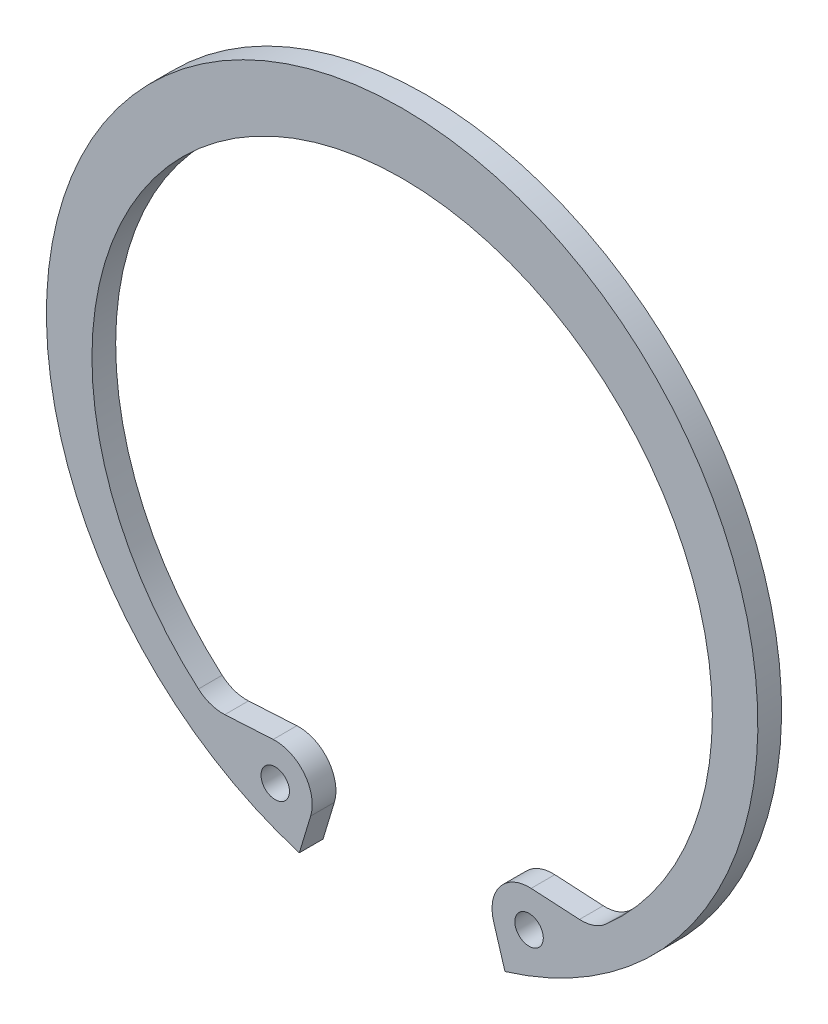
ISO-10303-21;
HEADER;
FILE_DESCRIPTION(('STEP AP214'),'2;1');
FILE_NAME('part.step','',(''),(''),'','','');
FILE_SCHEMA(('AUTOMOTIVE_DESIGN { 1 0 10303 214 1 1 1 1 }'));
ENDSEC;
DATA;
#1=APPLICATION_CONTEXT('core data for automotive mechanical design processes');
#2=APPLICATION_PROTOCOL_DEFINITION('international standard','automotive_design',2000,#1);
#3=PRODUCT_CONTEXT('',#1,'mechanical');
#4=PRODUCT('Part','Part','',(#3));
#5=PRODUCT_RELATED_PRODUCT_CATEGORY('part','',(#4));
#6=PRODUCT_DEFINITION_FORMATION('','',#4);
#7=PRODUCT_DEFINITION_CONTEXT('part definition',#1,'design');
#8=PRODUCT_DEFINITION('design','',#6,#7);
#9=PRODUCT_DEFINITION_SHAPE('','',#8);
#10=(LENGTH_UNIT() NAMED_UNIT(*) SI_UNIT(.MILLI.,.METRE.));
#11=(NAMED_UNIT(*) PLANE_ANGLE_UNIT() SI_UNIT($,.RADIAN.));
#12=(NAMED_UNIT(*) SI_UNIT($,.STERADIAN.) SOLID_ANGLE_UNIT());
#13=UNCERTAINTY_MEASURE_WITH_UNIT(LENGTH_MEASURE(1.E-05),#10,'distance_accuracy_value','');
#14=(GEOMETRIC_REPRESENTATION_CONTEXT(3) GLOBAL_UNCERTAINTY_ASSIGNED_CONTEXT((#13)) GLOBAL_UNIT_ASSIGNED_CONTEXT((#10,
#11,#12)) REPRESENTATION_CONTEXT('',''));
#15=CARTESIAN_POINT('',(0.,0.,0.));
#16=DIRECTION('',(0.,0.,1.));
#17=DIRECTION('',(1.,0.,0.));
#18=AXIS2_PLACEMENT_3D('',#15,#16,#17);
#19=CARTESIAN_POINT('',(0.,0.,2.5));
#20=DIRECTION('',(0.,0.,1.));
#21=DIRECTION('',(1.,0.,0.));
#22=AXIS2_PLACEMENT_3D('',#19,#20,#21);
#23=PLANE('',#22);
#24=CARTESIAN_POINT('',(13.3793733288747,-30.8212973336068,2.5));
#25=DIRECTION('',(0.,0.,1.));
#26=DIRECTION('',(1.,0.,0.));
#27=AXIS2_PLACEMENT_3D('',#24,#25,#26);
#28=CIRCLE('',#27,1.5);
#29=CARTESIAN_POINT('',(11.8793733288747,-30.8212973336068,2.5));
#30=VERTEX_POINT('',#29);
#31=EDGE_CURVE('E145',#30,#30,#28,.T.);
#32=ORIENTED_EDGE('',*,*,#31,.F.);
#33=EDGE_LOOP('',(#32));
#34=FACE_BOUND('',#33,.T.);
#35=CARTESIAN_POINT('',(0.,0.,2.5));
#36=DIRECTION('',(0.,0.,1.));
#37=DIRECTION('',(1.,0.,0.));
#38=AXIS2_PLACEMENT_3D('',#35,#36,#37);
#39=CIRCLE('',#38,37.5);
#40=CARTESIAN_POINT('',(10.8386923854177,-35.8994811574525,2.5));
#41=VERTEX_POINT('',#40);
#42=CARTESIAN_POINT('',(-10.8386923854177,-35.8994811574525,2.5));
#43=VERTEX_POINT('',#42);
#44=EDGE_CURVE('E160',#41,#43,#39,.T.);
#45=ORIENTED_EDGE('',*,*,#44,.T.);
#46=DIRECTION('',(0.289031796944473,0.957319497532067,0.));
#47=VECTOR('',#46,1.);
#48=CARTESIAN_POINT('',(-9.64582728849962,-31.9485213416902,2.5));
#49=LINE('',#48,#47);
#50=CARTESIAN_POINT('',(-9.64582728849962,-31.9485213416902,2.5));
#51=VERTEX_POINT('',#50);
#52=EDGE_CURVE('E98',#43,#51,#49,.T.);
#53=ORIENTED_EDGE('',*,*,#52,.T.);
#54=CARTESIAN_POINT('',(-13.3793733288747,-30.8212973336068,2.5));
#55=DIRECTION('',(0.,0.,1.));
#56=DIRECTION('',(-1.,0.,0.));
#57=AXIS2_PLACEMENT_3D('',#54,#55,#56);
#58=CIRCLE('',#57,3.9);
#59=CARTESIAN_POINT('',(-13.597077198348,-26.9273783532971,2.5));
#60=VERTEX_POINT('',#59);
#61=EDGE_CURVE('E181',#51,#60,#58,.T.);
#62=ORIENTED_EDGE('',*,*,#61,.T.);
#63=DIRECTION('',(-0.998440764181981,-0.0558215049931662,0.));
#64=VECTOR('',#63,1.);
#65=CARTESIAN_POINT('',(-18.6964250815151,-27.2124761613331,2.5));
#66=LINE('',#65,#64);
#67=CARTESIAN_POINT('',(-18.6964250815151,-27.2124761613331,2.5));
#68=VERTEX_POINT('',#67);
#69=EDGE_CURVE('E200',#60,#68,#66,.T.);
#70=ORIENTED_EDGE('',*,*,#69,.T.);
#71=CARTESIAN_POINT('',(-18.9141289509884,-23.3185571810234,2.5));
#72=DIRECTION('',(0.,0.,-1.));
#73=DIRECTION('',(-1.,0.,0.));
#74=AXIS2_PLACEMENT_3D('',#71,#72,#73);
#75=CIRCLE('',#74,3.9);
#76=CARTESIAN_POINT('',(-21.4754172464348,-26.259611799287,2.5));
#77=VERTEX_POINT('',#76);
#78=EDGE_CURVE('E197',#68,#77,#75,.T.);
#79=ORIENTED_EDGE('',*,*,#78,.T.);
#80=CARTESIAN_POINT('',(0.,-1.6,2.5));
#81=DIRECTION('',(0.,0.,-1.));
#82=DIRECTION('',(1.,0.,0.));
#83=AXIS2_PLACEMENT_3D('',#80,#81,#82);
#84=CIRCLE('',#83,32.7);
#85=CARTESIAN_POINT('',(21.4754172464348,-26.259611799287,2.5));
#86=VERTEX_POINT('',#85);
#87=EDGE_CURVE('E199',#77,#86,#84,.T.);
#88=ORIENTED_EDGE('',*,*,#87,.T.);
#89=CARTESIAN_POINT('',(18.9141289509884,-23.3185571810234,2.5));
#90=DIRECTION('',(0.,0.,-1.));
#91=DIRECTION('',(1.,0.,0.));
#92=AXIS2_PLACEMENT_3D('',#89,#90,#91);
#93=CIRCLE('',#92,3.9);
#94=CARTESIAN_POINT('',(18.6964250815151,-27.2124761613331,2.5));
#95=VERTEX_POINT('',#94);
#96=EDGE_CURVE('E123',#86,#95,#93,.T.);
#97=ORIENTED_EDGE('',*,*,#96,.T.);
#98=DIRECTION('',(-0.998440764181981,0.0558215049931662,0.));
#99=VECTOR('',#98,1.);
#100=CARTESIAN_POINT('',(18.6964250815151,-27.2124761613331,2.5));
#101=LINE('',#100,#99);
#102=CARTESIAN_POINT('',(13.597077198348,-26.9273783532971,2.5));
#103=VERTEX_POINT('',#102);
#104=EDGE_CURVE('E117',#95,#103,#101,.T.);
#105=ORIENTED_EDGE('',*,*,#104,.T.);
#106=CARTESIAN_POINT('',(13.3793733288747,-30.8212973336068,2.5));
#107=DIRECTION('',(0.,0.,1.));
#108=DIRECTION('',(1.,0.,0.));
#109=AXIS2_PLACEMENT_3D('',#106,#107,#108);
#110=CIRCLE('',#109,3.9);
#111=CARTESIAN_POINT('',(9.64582728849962,-31.9485213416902,2.5));
#112=VERTEX_POINT('',#111);
#113=EDGE_CURVE('E121',#103,#112,#110,.T.);
#114=ORIENTED_EDGE('',*,*,#113,.T.);
#115=DIRECTION('',(0.289031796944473,-0.957319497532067,0.));
#116=VECTOR('',#115,1.);
#117=CARTESIAN_POINT('',(9.64582728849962,-31.9485213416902,2.5));
#118=LINE('',#117,#116);
#119=EDGE_CURVE('E49',#112,#41,#118,.T.);
#120=ORIENTED_EDGE('',*,*,#119,.T.);
#121=EDGE_LOOP('',(#45,#53,#62,#70,#79,#88,#97,#105,#114,#120));
#122=FACE_BOUND('',#121,.T.);
#123=CARTESIAN_POINT('',(-13.3793733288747,-30.8212973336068,2.5));
#124=DIRECTION('',(0.,0.,1.));
#125=DIRECTION('',(-1.,0.,0.));
#126=AXIS2_PLACEMENT_3D('',#123,#124,#125);
#127=CIRCLE('',#126,1.5);
#128=CARTESIAN_POINT('',(-14.8793733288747,-30.8212973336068,2.5));
#129=VERTEX_POINT('',#128);
#130=EDGE_CURVE('E211',#129,#129,#127,.T.);
#131=ORIENTED_EDGE('',*,*,#130,.F.);
#132=EDGE_LOOP('',(#131));
#133=FACE_BOUND('',#132,.T.);
#134=ADVANCED_FACE('F32',(#34,#122,#133),#23,.T.);
#135=CARTESIAN_POINT('',(0.,0.,0.));
#136=DIRECTION('',(0.,0.,1.));
#137=DIRECTION('',(1.,0.,0.));
#138=AXIS2_PLACEMENT_3D('',#135,#136,#137);
#139=PLANE('',#138);
#140=CARTESIAN_POINT('',(13.3793733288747,-30.8212973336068,0.));
#141=DIRECTION('',(0.,0.,1.));
#142=DIRECTION('',(1.,0.,0.));
#143=AXIS2_PLACEMENT_3D('',#140,#141,#142);
#144=CIRCLE('',#143,1.5);
#145=CARTESIAN_POINT('',(11.8793733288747,-30.8212973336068,0.));
#146=VERTEX_POINT('',#145);
#147=EDGE_CURVE('E208',#146,#146,#144,.T.);
#148=ORIENTED_EDGE('',*,*,#147,.T.);
#149=EDGE_LOOP('',(#148));
#150=FACE_BOUND('',#149,.T.);
#151=CARTESIAN_POINT('',(0.,0.,0.));
#152=DIRECTION('',(0.,0.,1.));
#153=DIRECTION('',(1.,0.,0.));
#154=AXIS2_PLACEMENT_3D('',#151,#152,#153);
#155=CIRCLE('',#154,37.5);
#156=CARTESIAN_POINT('',(10.8386923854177,-35.8994811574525,0.));
#157=VERTEX_POINT('',#156);
#158=CARTESIAN_POINT('',(-10.8386923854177,-35.8994811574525,0.));
#159=VERTEX_POINT('',#158);
#160=EDGE_CURVE('E141',#157,#159,#155,.T.);
#161=ORIENTED_EDGE('',*,*,#160,.F.);
#162=DIRECTION('',(0.289031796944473,-0.957319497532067,0.));
#163=VECTOR('',#162,1.);
#164=CARTESIAN_POINT('',(9.64582728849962,-31.9485213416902,0.));
#165=LINE('',#164,#163);
#166=CARTESIAN_POINT('',(9.64582728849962,-31.9485213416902,0.));
#167=VERTEX_POINT('',#166);
#168=EDGE_CURVE('E90',#167,#157,#165,.T.);
#169=ORIENTED_EDGE('',*,*,#168,.F.);
#170=CARTESIAN_POINT('',(13.3793733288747,-30.8212973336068,0.));
#171=DIRECTION('',(0.,0.,1.));
#172=DIRECTION('',(1.,0.,0.));
#173=AXIS2_PLACEMENT_3D('',#170,#171,#172);
#174=CIRCLE('',#173,3.9);
#175=CARTESIAN_POINT('',(13.597077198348,-26.9273783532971,0.));
#176=VERTEX_POINT('',#175);
#177=EDGE_CURVE('E84',#176,#167,#174,.T.);
#178=ORIENTED_EDGE('',*,*,#177,.F.);
#179=DIRECTION('',(-0.998440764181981,0.0558215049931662,0.));
#180=VECTOR('',#179,1.);
#181=CARTESIAN_POINT('',(18.6964250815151,-27.2124761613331,0.));
#182=LINE('',#181,#180);
#183=CARTESIAN_POINT('',(18.6964250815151,-27.2124761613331,0.));
#184=VERTEX_POINT('',#183);
#185=EDGE_CURVE('E131',#184,#176,#182,.T.);
#186=ORIENTED_EDGE('',*,*,#185,.F.);
#187=CARTESIAN_POINT('',(18.9141289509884,-23.3185571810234,0.));
#188=DIRECTION('',(0.,0.,-1.));
#189=DIRECTION('',(1.,0.,0.));
#190=AXIS2_PLACEMENT_3D('',#187,#188,#189);
#191=CIRCLE('',#190,3.9);
#192=CARTESIAN_POINT('',(21.4754172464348,-26.259611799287,0.));
#193=VERTEX_POINT('',#192);
#194=EDGE_CURVE('E155',#193,#184,#191,.T.);
#195=ORIENTED_EDGE('',*,*,#194,.F.);
#196=CARTESIAN_POINT('',(0.,-1.6,0.));
#197=DIRECTION('',(0.,0.,-1.));
#198=DIRECTION('',(1.,0.,0.));
#199=AXIS2_PLACEMENT_3D('',#196,#197,#198);
#200=CIRCLE('',#199,32.7);
#201=CARTESIAN_POINT('',(-21.4754172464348,-26.259611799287,0.));
#202=VERTEX_POINT('',#201);
#203=EDGE_CURVE('E153',#202,#193,#200,.T.);
#204=ORIENTED_EDGE('',*,*,#203,.F.);
#205=CARTESIAN_POINT('',(-18.9141289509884,-23.3185571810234,0.));
#206=DIRECTION('',(0.,0.,-1.));
#207=DIRECTION('',(-1.,0.,0.));
#208=AXIS2_PLACEMENT_3D('',#205,#206,#207);
#209=CIRCLE('',#208,3.9);
#210=CARTESIAN_POINT('',(-18.6964250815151,-27.2124761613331,0.));
#211=VERTEX_POINT('',#210);
#212=EDGE_CURVE('E151',#211,#202,#209,.T.);
#213=ORIENTED_EDGE('',*,*,#212,.F.);
#214=DIRECTION('',(-0.998440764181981,-0.0558215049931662,0.));
#215=VECTOR('',#214,1.);
#216=CARTESIAN_POINT('',(-18.6964250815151,-27.2124761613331,0.));
#217=LINE('',#216,#215);
#218=CARTESIAN_POINT('',(-13.597077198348,-26.9273783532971,0.));
#219=VERTEX_POINT('',#218);
#220=EDGE_CURVE('E149',#219,#211,#217,.T.);
#221=ORIENTED_EDGE('',*,*,#220,.F.);
#222=CARTESIAN_POINT('',(-13.3793733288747,-30.8212973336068,0.));
#223=DIRECTION('',(0.,0.,1.));
#224=DIRECTION('',(-1.,0.,0.));
#225=AXIS2_PLACEMENT_3D('',#222,#223,#224);
#226=CIRCLE('',#225,3.9);
#227=CARTESIAN_POINT('',(-9.64582728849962,-31.9485213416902,0.));
#228=VERTEX_POINT('',#227);
#229=EDGE_CURVE('E147',#228,#219,#226,.T.);
#230=ORIENTED_EDGE('',*,*,#229,.F.);
#231=DIRECTION('',(0.289031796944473,0.957319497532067,0.));
#232=VECTOR('',#231,1.);
#233=CARTESIAN_POINT('',(-9.64582728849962,-31.9485213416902,0.));
#234=LINE('',#233,#232);
#235=EDGE_CURVE('E144',#159,#228,#234,.T.);
#236=ORIENTED_EDGE('',*,*,#235,.F.);
#237=EDGE_LOOP('',(#161,#169,#178,#186,#195,#204,#213,#221,#230,#236));
#238=FACE_BOUND('',#237,.T.);
#239=CARTESIAN_POINT('',(-13.3793733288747,-30.8212973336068,0.));
#240=DIRECTION('',(0.,0.,1.));
#241=DIRECTION('',(-1.,0.,0.));
#242=AXIS2_PLACEMENT_3D('',#239,#240,#241);
#243=CIRCLE('',#242,1.5);
#244=CARTESIAN_POINT('',(-14.8793733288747,-30.8212973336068,0.));
#245=VERTEX_POINT('',#244);
#246=EDGE_CURVE('E214',#245,#245,#243,.T.);
#247=ORIENTED_EDGE('',*,*,#246,.T.);
#248=EDGE_LOOP('',(#247));
#249=FACE_BOUND('',#248,.T.);
#250=ADVANCED_FACE('F185',(#150,#238,#249),#139,.F.);
#251=CARTESIAN_POINT('',(0.,0.,2.5));
#252=DIRECTION('',(0.,0.,-1.));
#253=DIRECTION('',(-1.,0.,0.));
#254=AXIS2_PLACEMENT_3D('',#251,#252,#253);
#255=CYLINDRICAL_SURFACE('',#254,37.5);
#256=ORIENTED_EDGE('',*,*,#160,.T.);
#257=DIRECTION('',(0.,0.,-1.));
#258=VECTOR('',#257,1.);
#259=CARTESIAN_POINT('',(-10.8386923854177,-35.8994811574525,2.5));
#260=LINE('',#259,#258);
#261=EDGE_CURVE('E11',#43,#159,#260,.T.);
#262=ORIENTED_EDGE('',*,*,#261,.F.);
#263=ORIENTED_EDGE('',*,*,#44,.F.);
#264=DIRECTION('',(0.,0.,-1.));
#265=VECTOR('',#264,1.);
#266=CARTESIAN_POINT('',(10.8386923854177,-35.8994811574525,2.5));
#267=LINE('',#266,#265);
#268=EDGE_CURVE('E137',#41,#157,#267,.T.);
#269=ORIENTED_EDGE('',*,*,#268,.T.);
#270=EDGE_LOOP('',(#256,#262,#263,#269));
#271=FACE_BOUND('',#270,.T.);
#272=ADVANCED_FACE('F34',(#271),#255,.T.);
#273=CARTESIAN_POINT('',(-9.64582728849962,-31.9485213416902,2.5));
#274=DIRECTION('',(-0.957319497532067,0.289031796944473,0.));
#275=DIRECTION('',(-0.289031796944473,-0.957319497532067,0.));
#276=AXIS2_PLACEMENT_3D('',#273,#274,#275);
#277=PLANE('',#276);
#278=ORIENTED_EDGE('',*,*,#235,.T.);
#279=DIRECTION('',(0.,0.,-1.));
#280=VECTOR('',#279,1.);
#281=CARTESIAN_POINT('',(-9.64582728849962,-31.9485213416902,2.5));
#282=LINE('',#281,#280);
#283=EDGE_CURVE('E41',#51,#228,#282,.T.);
#284=ORIENTED_EDGE('',*,*,#283,.F.);
#285=ORIENTED_EDGE('',*,*,#52,.F.);
#286=ORIENTED_EDGE('',*,*,#261,.T.);
#287=EDGE_LOOP('',(#278,#284,#285,#286));
#288=FACE_BOUND('',#287,.T.);
#289=ADVANCED_FACE('F255',(#288),#277,.F.);
#290=CARTESIAN_POINT('',(-13.3793733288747,-30.8212973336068,2.5));
#291=DIRECTION('',(0.,0.,-1.));
#292=DIRECTION('',(-1.,0.,0.));
#293=AXIS2_PLACEMENT_3D('',#290,#291,#292);
#294=CYLINDRICAL_SURFACE('',#293,3.9);
#295=ORIENTED_EDGE('',*,*,#229,.T.);
#296=DIRECTION('',(0.,0.,-1.));
#297=VECTOR('',#296,1.);
#298=CARTESIAN_POINT('',(-13.597077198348,-26.9273783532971,2.5));
#299=LINE('',#298,#297);
#300=EDGE_CURVE('E173',#60,#219,#299,.T.);
#301=ORIENTED_EDGE('',*,*,#300,.F.);
#302=ORIENTED_EDGE('',*,*,#61,.F.);
#303=ORIENTED_EDGE('',*,*,#283,.T.);
#304=EDGE_LOOP('',(#295,#301,#302,#303));
#305=FACE_BOUND('',#304,.T.);
#306=ADVANCED_FACE('F179',(#305),#294,.T.);
#307=CARTESIAN_POINT('',(-18.6964250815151,-27.2124761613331,2.5));
#308=DIRECTION('',(0.0558215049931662,-0.998440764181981,0.));
#309=DIRECTION('',(0.998440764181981,0.0558215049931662,0.));
#310=AXIS2_PLACEMENT_3D('',#307,#308,#309);
#311=PLANE('',#310);
#312=ORIENTED_EDGE('',*,*,#220,.T.);
#313=DIRECTION('',(0.,0.,-1.));
#314=VECTOR('',#313,1.);
#315=CARTESIAN_POINT('',(-18.6964250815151,-27.2124761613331,2.5));
#316=LINE('',#315,#314);
#317=EDGE_CURVE('E170',#68,#211,#316,.T.);
#318=ORIENTED_EDGE('',*,*,#317,.F.);
#319=ORIENTED_EDGE('',*,*,#69,.F.);
#320=ORIENTED_EDGE('',*,*,#300,.T.);
#321=EDGE_LOOP('',(#312,#318,#319,#320));
#322=FACE_BOUND('',#321,.T.);
#323=ADVANCED_FACE('F191',(#322),#311,.F.);
#324=CARTESIAN_POINT('',(-18.9141289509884,-23.3185571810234,2.5));
#325=DIRECTION('',(0.,0.,-1.));
#326=DIRECTION('',(-1.,0.,0.));
#327=AXIS2_PLACEMENT_3D('',#324,#325,#326);
#328=CYLINDRICAL_SURFACE('',#327,3.9);
#329=ORIENTED_EDGE('',*,*,#212,.T.);
#330=DIRECTION('',(0.,0.,-1.));
#331=VECTOR('',#330,1.);
#332=CARTESIAN_POINT('',(-21.4754172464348,-26.259611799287,2.5));
#333=LINE('',#332,#331);
#334=EDGE_CURVE('E167',#77,#202,#333,.T.);
#335=ORIENTED_EDGE('',*,*,#334,.F.);
#336=ORIENTED_EDGE('',*,*,#78,.F.);
#337=ORIENTED_EDGE('',*,*,#317,.T.);
#338=EDGE_LOOP('',(#329,#335,#336,#337));
#339=FACE_BOUND('',#338,.T.);
#340=ADVANCED_FACE('F195',(#339),#328,.F.);
#341=CARTESIAN_POINT('',(0.,-1.6,2.5));
#342=DIRECTION('',(0.,0.,-1.));
#343=DIRECTION('',(-1.,0.,0.));
#344=AXIS2_PLACEMENT_3D('',#341,#342,#343);
#345=CYLINDRICAL_SURFACE('',#344,32.7);
#346=ORIENTED_EDGE('',*,*,#203,.T.);
#347=DIRECTION('',(0.,0.,-1.));
#348=VECTOR('',#347,1.);
#349=CARTESIAN_POINT('',(21.4754172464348,-26.259611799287,2.5));
#350=LINE('',#349,#348);
#351=EDGE_CURVE('E164',#86,#193,#350,.T.);
#352=ORIENTED_EDGE('',*,*,#351,.F.);
#353=ORIENTED_EDGE('',*,*,#87,.F.);
#354=ORIENTED_EDGE('',*,*,#334,.T.);
#355=EDGE_LOOP('',(#346,#352,#353,#354));
#356=FACE_BOUND('',#355,.T.);
#357=ADVANCED_FACE('F245',(#356),#345,.F.);
#358=CARTESIAN_POINT('',(18.9141289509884,-23.3185571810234,2.5));
#359=DIRECTION('',(0.,0.,-1.));
#360=DIRECTION('',(-1.,0.,0.));
#361=AXIS2_PLACEMENT_3D('',#358,#359,#360);
#362=CYLINDRICAL_SURFACE('',#361,3.9);
#363=ORIENTED_EDGE('',*,*,#194,.T.);
#364=DIRECTION('',(0.,0.,-1.));
#365=VECTOR('',#364,1.);
#366=CARTESIAN_POINT('',(18.6964250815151,-27.2124761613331,2.5));
#367=LINE('',#366,#365);
#368=EDGE_CURVE('E132',#95,#184,#367,.T.);
#369=ORIENTED_EDGE('',*,*,#368,.F.);
#370=ORIENTED_EDGE('',*,*,#96,.F.);
#371=ORIENTED_EDGE('',*,*,#351,.T.);
#372=EDGE_LOOP('',(#363,#369,#370,#371));
#373=FACE_BOUND('',#372,.T.);
#374=ADVANCED_FACE('F242',(#373),#362,.F.);
#375=CARTESIAN_POINT('',(18.6964250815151,-27.2124761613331,2.5));
#376=DIRECTION('',(-0.0558215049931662,-0.998440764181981,0.));
#377=DIRECTION('',(0.998440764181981,-0.0558215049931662,0.));
#378=AXIS2_PLACEMENT_3D('',#375,#376,#377);
#379=PLANE('',#378);
#380=ORIENTED_EDGE('',*,*,#185,.T.);
#381=DIRECTION('',(0.,0.,-1.));
#382=VECTOR('',#381,1.);
#383=CARTESIAN_POINT('',(13.597077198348,-26.9273783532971,2.5));
#384=LINE('',#383,#382);
#385=EDGE_CURVE('E128',#103,#176,#384,.T.);
#386=ORIENTED_EDGE('',*,*,#385,.F.);
#387=ORIENTED_EDGE('',*,*,#104,.F.);
#388=ORIENTED_EDGE('',*,*,#368,.T.);
#389=EDGE_LOOP('',(#380,#386,#387,#388));
#390=FACE_BOUND('',#389,.T.);
#391=ADVANCED_FACE('F129',(#390),#379,.F.);
#392=CARTESIAN_POINT('',(13.3793733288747,-30.8212973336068,2.5));
#393=DIRECTION('',(0.,0.,-1.));
#394=DIRECTION('',(-1.,0.,0.));
#395=AXIS2_PLACEMENT_3D('',#392,#393,#394);
#396=CYLINDRICAL_SURFACE('',#395,3.9);
#397=ORIENTED_EDGE('',*,*,#177,.T.);
#398=DIRECTION('',(0.,0.,-1.));
#399=VECTOR('',#398,1.);
#400=CARTESIAN_POINT('',(9.64582728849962,-31.9485213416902,2.5));
#401=LINE('',#400,#399);
#402=EDGE_CURVE('E133',#112,#167,#401,.T.);
#403=ORIENTED_EDGE('',*,*,#402,.F.);
#404=ORIENTED_EDGE('',*,*,#113,.F.);
#405=ORIENTED_EDGE('',*,*,#385,.T.);
#406=EDGE_LOOP('',(#397,#403,#404,#405));
#407=FACE_BOUND('',#406,.T.);
#408=ADVANCED_FACE('F135',(#407),#396,.T.);
#409=CARTESIAN_POINT('',(9.64582728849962,-31.9485213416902,2.5));
#410=DIRECTION('',(0.957319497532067,0.289031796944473,0.));
#411=DIRECTION('',(-0.289031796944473,0.957319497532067,0.));
#412=AXIS2_PLACEMENT_3D('',#409,#410,#411);
#413=PLANE('',#412);
#414=ORIENTED_EDGE('',*,*,#168,.T.);
#415=ORIENTED_EDGE('',*,*,#268,.F.);
#416=ORIENTED_EDGE('',*,*,#119,.F.);
#417=ORIENTED_EDGE('',*,*,#402,.T.);
#418=EDGE_LOOP('',(#414,#415,#416,#417));
#419=FACE_BOUND('',#418,.T.);
#420=ADVANCED_FACE('F235',(#419),#413,.F.);
#421=CARTESIAN_POINT('',(13.3793733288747,-30.8212973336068,2.5));
#422=DIRECTION('',(0.,0.,-1.));
#423=DIRECTION('',(-1.,0.,0.));
#424=AXIS2_PLACEMENT_3D('',#421,#422,#423);
#425=CYLINDRICAL_SURFACE('',#424,1.5);
#426=CARTESIAN_POINT('',(11.8793733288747,-30.8212973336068,2.5));
#427=CARTESIAN_POINT('',(11.8793733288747,-30.8212973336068,2.47395833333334));
#428=CARTESIAN_POINT('',(11.8793733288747,-30.8212973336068,2.44791666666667));
#429=CARTESIAN_POINT('',(11.8793733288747,-30.8212973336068,2.39583333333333));
#430=CARTESIAN_POINT('',(11.8793733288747,-30.8212973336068,2.36979166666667));
#431=CARTESIAN_POINT('',(11.8793733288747,-30.8212973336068,2.31770833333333));
#432=CARTESIAN_POINT('',(11.8793733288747,-30.8212973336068,2.29166666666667));
#433=CARTESIAN_POINT('',(11.8793733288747,-30.8212973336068,2.23958333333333));
#434=CARTESIAN_POINT('',(11.8793733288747,-30.8212973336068,2.21354166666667));
#435=CARTESIAN_POINT('',(11.8793733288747,-30.8212973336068,2.16145833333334));
#436=CARTESIAN_POINT('',(11.8793733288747,-30.8212973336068,2.13541666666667));
#437=CARTESIAN_POINT('',(11.8793733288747,-30.8212973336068,2.08333333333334));
#438=CARTESIAN_POINT('',(11.8793733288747,-30.8212973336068,2.05729166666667));
#439=CARTESIAN_POINT('',(11.8793733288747,-30.8212973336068,2.00520833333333));
#440=CARTESIAN_POINT('',(11.8793733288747,-30.8212973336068,1.97916666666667));
#441=CARTESIAN_POINT('',(11.8793733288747,-30.8212973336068,1.92708333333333));
#442=CARTESIAN_POINT('',(11.8793733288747,-30.8212973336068,1.90104166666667));
#443=CARTESIAN_POINT('',(11.8793733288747,-30.8212973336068,1.84895833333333));
#444=CARTESIAN_POINT('',(11.8793733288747,-30.8212973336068,1.82291666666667));
#445=CARTESIAN_POINT('',(11.8793733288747,-30.8212973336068,1.77083333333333));
#446=CARTESIAN_POINT('',(11.8793733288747,-30.8212973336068,1.74479166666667));
#447=CARTESIAN_POINT('',(11.8793733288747,-30.8212973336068,1.69270833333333));
#448=CARTESIAN_POINT('',(11.8793733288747,-30.8212973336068,1.66666666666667));
#449=CARTESIAN_POINT('',(11.8793733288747,-30.8212973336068,1.61458333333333));
#450=CARTESIAN_POINT('',(11.8793733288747,-30.8212973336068,1.58854166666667));
#451=CARTESIAN_POINT('',(11.8793733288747,-30.8212973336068,1.53645833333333));
#452=CARTESIAN_POINT('',(11.8793733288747,-30.8212973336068,1.51041666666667));
#453=CARTESIAN_POINT('',(11.8793733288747,-30.8212973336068,1.45833333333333));
#454=CARTESIAN_POINT('',(11.8793733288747,-30.8212973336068,1.43229166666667));
#455=CARTESIAN_POINT('',(11.8793733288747,-30.8212973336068,1.38020833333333));
#456=CARTESIAN_POINT('',(11.8793733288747,-30.8212973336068,1.35416666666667));
#457=CARTESIAN_POINT('',(11.8793733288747,-30.8212973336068,1.30208333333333));
#458=CARTESIAN_POINT('',(11.8793733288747,-30.8212973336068,1.27604166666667));
#459=CARTESIAN_POINT('',(11.8793733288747,-30.8212973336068,1.22395833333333));
#460=CARTESIAN_POINT('',(11.8793733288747,-30.8212973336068,1.19791666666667));
#461=CARTESIAN_POINT('',(11.8793733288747,-30.8212973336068,1.14583333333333));
#462=CARTESIAN_POINT('',(11.8793733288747,-30.8212973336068,1.11979166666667));
#463=CARTESIAN_POINT('',(11.8793733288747,-30.8212973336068,1.06770833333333));
#464=CARTESIAN_POINT('',(11.8793733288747,-30.8212973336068,1.04166666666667));
#465=CARTESIAN_POINT('',(11.8793733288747,-30.8212973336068,0.989583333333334));
#466=CARTESIAN_POINT('',(11.8793733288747,-30.8212973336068,0.963541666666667));
#467=CARTESIAN_POINT('',(11.8793733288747,-30.8212973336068,0.911458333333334));
#468=CARTESIAN_POINT('',(11.8793733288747,-30.8212973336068,0.885416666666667));
#469=CARTESIAN_POINT('',(11.8793733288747,-30.8212973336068,0.833333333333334));
#470=CARTESIAN_POINT('',(11.8793733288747,-30.8212973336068,0.807291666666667));
#471=CARTESIAN_POINT('',(11.8793733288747,-30.8212973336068,0.755208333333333));
#472=CARTESIAN_POINT('',(11.8793733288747,-30.8212973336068,0.729166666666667));
#473=CARTESIAN_POINT('',(11.8793733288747,-30.8212973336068,0.677083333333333));
#474=CARTESIAN_POINT('',(11.8793733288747,-30.8212973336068,0.651041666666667));
#475=CARTESIAN_POINT('',(11.8793733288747,-30.8212973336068,0.598958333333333));
#476=CARTESIAN_POINT('',(11.8793733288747,-30.8212973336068,0.572916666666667));
#477=CARTESIAN_POINT('',(11.8793733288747,-30.8212973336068,0.520833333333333));
#478=CARTESIAN_POINT('',(11.8793733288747,-30.8212973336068,0.494791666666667));
#479=CARTESIAN_POINT('',(11.8793733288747,-30.8212973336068,0.442708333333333));
#480=CARTESIAN_POINT('',(11.8793733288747,-30.8212973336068,0.416666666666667));
#481=CARTESIAN_POINT('',(11.8793733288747,-30.8212973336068,0.364583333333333));
#482=CARTESIAN_POINT('',(11.8793733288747,-30.8212973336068,0.338541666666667));
#483=CARTESIAN_POINT('',(11.8793733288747,-30.8212973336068,0.286458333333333));
#484=CARTESIAN_POINT('',(11.8793733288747,-30.8212973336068,0.260416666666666));
#485=CARTESIAN_POINT('',(11.8793733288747,-30.8212973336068,0.208333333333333));
#486=CARTESIAN_POINT('',(11.8793733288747,-30.8212973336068,0.182291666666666));
#487=CARTESIAN_POINT('',(11.8793733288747,-30.8212973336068,0.130208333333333));
#488=CARTESIAN_POINT('',(11.8793733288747,-30.8212973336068,0.104166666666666));
#489=CARTESIAN_POINT('',(11.8793733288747,-30.8212973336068,0.052083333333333));
#490=CARTESIAN_POINT('',(11.8793733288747,-30.8212973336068,0.0260416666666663));
#491=CARTESIAN_POINT('',(11.8793733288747,-30.8212973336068,0.));
#492=B_SPLINE_CURVE_WITH_KNOTS('',3,(#426,#427,#428,#429,#430,#431,#432,#433,#434,#435,#436,
#437,#438,#439,#440,#441,#442,#443,#444,#445,#446,#447,#448,#449,#450,#451,#452,#453,#454,#455,
#456,#457,#458,#459,#460,#461,#462,#463,#464,#465,#466,#467,#468,#469,#470,#471,#472,#473,#474,
#475,#476,#477,#478,#479,#480,#481,#482,#483,#484,#485,#486,#487,#488,#489,#490,#491),
.UNSPECIFIED.,.F.,.F.,(4,2,2,2,2,2,2,2,2,2,2,2,2,2,2,2,2,2,2,2,2,2,2,2,2,2,2,2,2,2,2,2,4),(0.,
0.0781250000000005,0.156250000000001,0.234375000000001,0.312500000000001,0.390625,
0.468750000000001,0.546875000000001,0.625000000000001,0.703125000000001,0.781250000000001,
0.859375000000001,0.937500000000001,1.015625,1.09375,1.171875,1.25,1.328125,1.40625,1.484375,
1.5625,1.640625,1.71875,1.796875,1.875,1.953125,2.03125,2.109375,2.1875,2.265625,2.34375,
2.421875,2.5),.UNSPECIFIED.);
#493=EDGE_CURVE('BSEAM232',#30,#146,#492,.T.);
#494=ORIENTED_EDGE('',*,*,#31,.T.);
#495=ORIENTED_EDGE('',*,*,#147,.F.);
#496=ORIENTED_EDGE('',*,*,#493,.T.);
#497=ORIENTED_EDGE('',*,*,#493,.F.);
#498=EDGE_LOOP('',(#494,#496,#495,#497));
#499=FACE_BOUND('',#498,.T.);
#500=ADVANCED_FACE('F232',(#499),#425,.F.);
#501=CARTESIAN_POINT('',(-13.3793733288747,-30.8212973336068,2.5));
#502=DIRECTION('',(0.,0.,-1.));
#503=DIRECTION('',(-1.,0.,0.));
#504=AXIS2_PLACEMENT_3D('',#501,#502,#503);
#505=CYLINDRICAL_SURFACE('',#504,1.5);
#506=CARTESIAN_POINT('',(-14.8793733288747,-30.8212973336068,2.5));
#507=CARTESIAN_POINT('',(-14.8793733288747,-30.8212973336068,2.47395833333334));
#508=CARTESIAN_POINT('',(-14.8793733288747,-30.8212973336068,2.44791666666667));
#509=CARTESIAN_POINT('',(-14.8793733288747,-30.8212973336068,2.39583333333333));
#510=CARTESIAN_POINT('',(-14.8793733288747,-30.8212973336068,2.36979166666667));
#511=CARTESIAN_POINT('',(-14.8793733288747,-30.8212973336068,2.31770833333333));
#512=CARTESIAN_POINT('',(-14.8793733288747,-30.8212973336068,2.29166666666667));
#513=CARTESIAN_POINT('',(-14.8793733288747,-30.8212973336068,2.23958333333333));
#514=CARTESIAN_POINT('',(-14.8793733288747,-30.8212973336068,2.21354166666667));
#515=CARTESIAN_POINT('',(-14.8793733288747,-30.8212973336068,2.16145833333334));
#516=CARTESIAN_POINT('',(-14.8793733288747,-30.8212973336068,2.13541666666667));
#517=CARTESIAN_POINT('',(-14.8793733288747,-30.8212973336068,2.08333333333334));
#518=CARTESIAN_POINT('',(-14.8793733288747,-30.8212973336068,2.05729166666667));
#519=CARTESIAN_POINT('',(-14.8793733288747,-30.8212973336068,2.00520833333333));
#520=CARTESIAN_POINT('',(-14.8793733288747,-30.8212973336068,1.97916666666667));
#521=CARTESIAN_POINT('',(-14.8793733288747,-30.8212973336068,1.92708333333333));
#522=CARTESIAN_POINT('',(-14.8793733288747,-30.8212973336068,1.90104166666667));
#523=CARTESIAN_POINT('',(-14.8793733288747,-30.8212973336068,1.84895833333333));
#524=CARTESIAN_POINT('',(-14.8793733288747,-30.8212973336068,1.82291666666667));
#525=CARTESIAN_POINT('',(-14.8793733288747,-30.8212973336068,1.77083333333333));
#526=CARTESIAN_POINT('',(-14.8793733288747,-30.8212973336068,1.74479166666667));
#527=CARTESIAN_POINT('',(-14.8793733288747,-30.8212973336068,1.69270833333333));
#528=CARTESIAN_POINT('',(-14.8793733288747,-30.8212973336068,1.66666666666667));
#529=CARTESIAN_POINT('',(-14.8793733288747,-30.8212973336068,1.61458333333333));
#530=CARTESIAN_POINT('',(-14.8793733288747,-30.8212973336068,1.58854166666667));
#531=CARTESIAN_POINT('',(-14.8793733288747,-30.8212973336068,1.53645833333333));
#532=CARTESIAN_POINT('',(-14.8793733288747,-30.8212973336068,1.51041666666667));
#533=CARTESIAN_POINT('',(-14.8793733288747,-30.8212973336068,1.45833333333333));
#534=CARTESIAN_POINT('',(-14.8793733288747,-30.8212973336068,1.43229166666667));
#535=CARTESIAN_POINT('',(-14.8793733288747,-30.8212973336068,1.38020833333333));
#536=CARTESIAN_POINT('',(-14.8793733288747,-30.8212973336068,1.35416666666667));
#537=CARTESIAN_POINT('',(-14.8793733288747,-30.8212973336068,1.30208333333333));
#538=CARTESIAN_POINT('',(-14.8793733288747,-30.8212973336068,1.27604166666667));
#539=CARTESIAN_POINT('',(-14.8793733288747,-30.8212973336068,1.22395833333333));
#540=CARTESIAN_POINT('',(-14.8793733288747,-30.8212973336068,1.19791666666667));
#541=CARTESIAN_POINT('',(-14.8793733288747,-30.8212973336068,1.14583333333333));
#542=CARTESIAN_POINT('',(-14.8793733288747,-30.8212973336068,1.11979166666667));
#543=CARTESIAN_POINT('',(-14.8793733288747,-30.8212973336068,1.06770833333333));
#544=CARTESIAN_POINT('',(-14.8793733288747,-30.8212973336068,1.04166666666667));
#545=CARTESIAN_POINT('',(-14.8793733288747,-30.8212973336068,0.989583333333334));
#546=CARTESIAN_POINT('',(-14.8793733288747,-30.8212973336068,0.963541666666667));
#547=CARTESIAN_POINT('',(-14.8793733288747,-30.8212973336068,0.911458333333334));
#548=CARTESIAN_POINT('',(-14.8793733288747,-30.8212973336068,0.885416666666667));
#549=CARTESIAN_POINT('',(-14.8793733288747,-30.8212973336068,0.833333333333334));
#550=CARTESIAN_POINT('',(-14.8793733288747,-30.8212973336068,0.807291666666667));
#551=CARTESIAN_POINT('',(-14.8793733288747,-30.8212973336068,0.755208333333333));
#552=CARTESIAN_POINT('',(-14.8793733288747,-30.8212973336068,0.729166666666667));
#553=CARTESIAN_POINT('',(-14.8793733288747,-30.8212973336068,0.677083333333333));
#554=CARTESIAN_POINT('',(-14.8793733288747,-30.8212973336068,0.651041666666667));
#555=CARTESIAN_POINT('',(-14.8793733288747,-30.8212973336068,0.598958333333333));
#556=CARTESIAN_POINT('',(-14.8793733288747,-30.8212973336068,0.572916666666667));
#557=CARTESIAN_POINT('',(-14.8793733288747,-30.8212973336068,0.520833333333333));
#558=CARTESIAN_POINT('',(-14.8793733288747,-30.8212973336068,0.494791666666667));
#559=CARTESIAN_POINT('',(-14.8793733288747,-30.8212973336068,0.442708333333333));
#560=CARTESIAN_POINT('',(-14.8793733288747,-30.8212973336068,0.416666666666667));
#561=CARTESIAN_POINT('',(-14.8793733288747,-30.8212973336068,0.364583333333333));
#562=CARTESIAN_POINT('',(-14.8793733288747,-30.8212973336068,0.338541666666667));
#563=CARTESIAN_POINT('',(-14.8793733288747,-30.8212973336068,0.286458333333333));
#564=CARTESIAN_POINT('',(-14.8793733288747,-30.8212973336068,0.260416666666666));
#565=CARTESIAN_POINT('',(-14.8793733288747,-30.8212973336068,0.208333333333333));
#566=CARTESIAN_POINT('',(-14.8793733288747,-30.8212973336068,0.182291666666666));
#567=CARTESIAN_POINT('',(-14.8793733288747,-30.8212973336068,0.130208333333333));
#568=CARTESIAN_POINT('',(-14.8793733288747,-30.8212973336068,0.104166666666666));
#569=CARTESIAN_POINT('',(-14.8793733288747,-30.8212973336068,0.052083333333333));
#570=CARTESIAN_POINT('',(-14.8793733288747,-30.8212973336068,0.0260416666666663));
#571=CARTESIAN_POINT('',(-14.8793733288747,-30.8212973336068,0.));
#572=B_SPLINE_CURVE_WITH_KNOTS('',3,(#506,#507,#508,#509,#510,#511,#512,#513,#514,#515,#516,
#517,#518,#519,#520,#521,#522,#523,#524,#525,#526,#527,#528,#529,#530,#531,#532,#533,#534,#535,
#536,#537,#538,#539,#540,#541,#542,#543,#544,#545,#546,#547,#548,#549,#550,#551,#552,#553,#554,
#555,#556,#557,#558,#559,#560,#561,#562,#563,#564,#565,#566,#567,#568,#569,#570,#571),
.UNSPECIFIED.,.F.,.F.,(4,2,2,2,2,2,2,2,2,2,2,2,2,2,2,2,2,2,2,2,2,2,2,2,2,2,2,2,2,2,2,2,4),(0.,
0.0781250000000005,0.156250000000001,0.234375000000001,0.312500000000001,0.390625,
0.468750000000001,0.546875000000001,0.625000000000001,0.703125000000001,0.781250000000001,
0.859375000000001,0.937500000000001,1.015625,1.09375,1.171875,1.25,1.328125,1.40625,1.484375,
1.5625,1.640625,1.71875,1.796875,1.875,1.953125,2.03125,2.109375,2.1875,2.265625,2.34375,
2.421875,2.5),.UNSPECIFIED.);
#573=EDGE_CURVE('BSEAM220',#129,#245,#572,.T.);
#574=ORIENTED_EDGE('',*,*,#130,.T.);
#575=ORIENTED_EDGE('',*,*,#246,.F.);
#576=ORIENTED_EDGE('',*,*,#573,.T.);
#577=ORIENTED_EDGE('',*,*,#573,.F.);
#578=EDGE_LOOP('',(#574,#576,#575,#577));
#579=FACE_BOUND('',#578,.T.);
#580=ADVANCED_FACE('F220',(#579),#505,.F.);
#581=CLOSED_SHELL('',(#134,#250,#272,#289,#306,#323,#340,#357,#374,#391,#408,#420,#500,#580));
#582=MANIFOLD_SOLID_BREP('B2',#581);
#583=ADVANCED_BREP_SHAPE_REPRESENTATION('',(#18,#582),#14);
#584=SHAPE_DEFINITION_REPRESENTATION(#9,#583);
ENDSEC;
END-ISO-10303-21;
